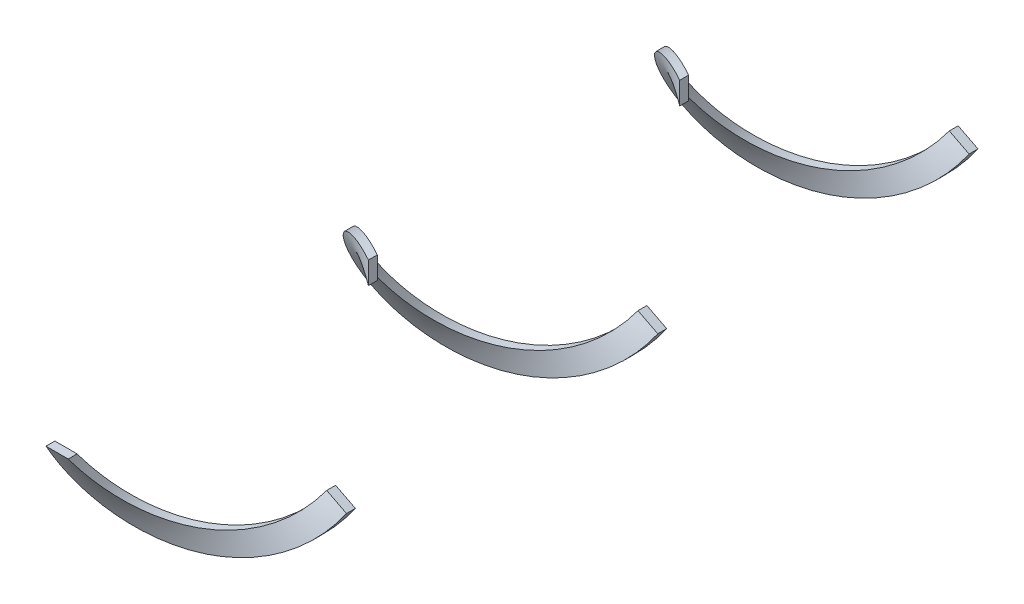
from build123d import *

# Parameters (mm, degrees)
T_HNOUT_PO_K_IVCE3_PITCH       = 70
T_HNOUT_PO_K_IVCE3_HEIGHT      = 210
T_HNOUT_PO_K_IVCE3_RADIUS      = 17.5
T_HNOUT_PO_K_IVCE3_START_ANGLE = -180
SKICA7_W                       = 5
SKICA7_H                       = 2
M_TKO1_SCALE                   = 0.655
ODEBRAT_VYSUNUT_M1_DEPTH       = 140.441178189
ODEBRAT_VYSUNUT_M2_DEPTH       = 30
ODEBRAT_VYSUNUT_M2_DEPTH_BACK  = 30
SKICA9_R                       = 30.360360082


with BuildPart() as part:
    # T_hnout po k_ivce3: sweep along a helix
    with BuildLine() as t_hnout_po_k_ivce3_path:
        add(Helix(T_HNOUT_PO_K_IVCE3_PITCH, T_HNOUT_PO_K_IVCE3_HEIGHT, T_HNOUT_PO_K_IVCE3_RADIUS, center=(0, 0, 0), direction=(0, 0, 1), lefthand=True, mode=Mode.PRIVATE).rotate(Axis((0, 0, 0), (0, 0, 1)), T_HNOUT_PO_K_IVCE3_START_ANGLE))
    # Skica7 → T_hnout po k_ivce3 (sweep)
    with BuildSketch(Plane(origin=(-17.5, 0, 0), x_dir=(-1, 0, 0), z_dir=(0, -1, 0))):
        Rectangle(SKICA7_W, SKICA7_H)
    sweep(path=t_hnout_po_k_ivce3_path.line, is_frenet=True)


with BuildPart() as part_1:
    # M_tko1: scaled about (0, 0, 0)
    add(part.part.scale(M_TKO1_SCALE))

    # Skica8 → Odebrat vysunut_m1 (cut, through all)
    with BuildSketch(Plane.XY):
        with BuildLine():
            Line((0, 29.81130579), (0, 0))
            Line((0, 0), (26.562067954, -13.534049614))
            ThreePointArc((26.562067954, -13.534049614), (28.987617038, -6.959311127), (29.81130579, 0))
            ThreePointArc((29.81130579, 0), (21.07977648, 21.07977648), (0, 29.81130579))
        make_face()
    extrude(amount=ODEBRAT_VYSUNUT_M1_DEPTH, mode=Mode.SUBTRACT)


with BuildPart() as odebrat_vysunut_m1_piece_1:
    # of the separate pieces the step leaves, piece 1, a body of its own (odebrat_vysunut_m1_pieces)
    add(part_1.part.solids().sort_by_distance((8.754139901, -4.460457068, 27.018749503))[0])


with BuildPart() as odebrat_vysunut_m1_piece_2:
    # of the separate pieces the step leaves, piece 2, a body of its own (odebrat_vysunut_m1_pieces)
    add(part_1.part.solids().sort_by_distance((8.754140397, -4.460457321, 72.868749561))[0])


with BuildPart() as odebrat_vysunut_m1_piece_3:
    # of the separate pieces the step leaves, piece 3, a body of its own (odebrat_vysunut_m1_pieces)
    add(part_1.part.solids().sort_by_distance((8.754138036, -4.460456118, 118.718747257))[0])


with BuildPart() as odebrat_vysunut_m1_piece_4:
    # of the separate pieces the step leaves, piece 4, a body of its own (odebrat_vysunut_m1_pieces)
    add(part_1.part.solids().sort_by_distance((-9.825, 0, 0.655))[0])

    # Skica9 → Odebrat vysunut_m2 (cut, two sides: drawn at the far end of the back side and taken through both)
    with BuildSketch(Plane.XY.offset(-ODEBRAT_VYSUNUT_M2_DEPTH_BACK)):
        Circle(SKICA9_R)
    extrude(amount=ODEBRAT_VYSUNUT_M2_DEPTH + ODEBRAT_VYSUNUT_M2_DEPTH_BACK, mode=Mode.SUBTRACT)


solid = Compound([odebrat_vysunut_m1_piece_1.part, odebrat_vysunut_m1_piece_2.part, odebrat_vysunut_m1_piece_3.part])
